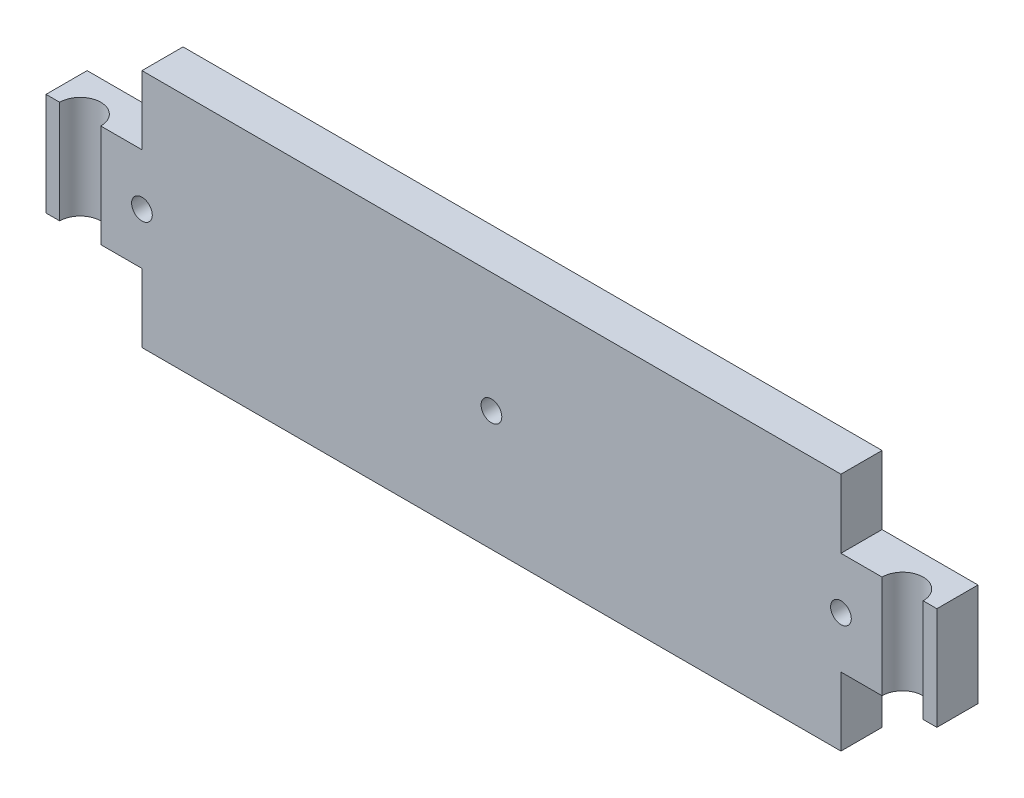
ISO-10303-21;
HEADER;
FILE_DESCRIPTION(('STEP AP214'),'2;1');
FILE_NAME('part.step','',(''),(''),'','','');
FILE_SCHEMA(('AUTOMOTIVE_DESIGN { 1 0 10303 214 1 1 1 1 }'));
ENDSEC;
DATA;
#1=APPLICATION_CONTEXT('core data for automotive mechanical design processes');
#2=APPLICATION_PROTOCOL_DEFINITION('international standard','automotive_design',2000,#1);
#3=PRODUCT_CONTEXT('',#1,'mechanical');
#4=PRODUCT('Part','Part','',(#3));
#5=PRODUCT_RELATED_PRODUCT_CATEGORY('part','',(#4));
#6=PRODUCT_DEFINITION_FORMATION('','',#4);
#7=PRODUCT_DEFINITION_CONTEXT('part definition',#1,'design');
#8=PRODUCT_DEFINITION('design','',#6,#7);
#9=PRODUCT_DEFINITION_SHAPE('','',#8);
#10=(LENGTH_UNIT() NAMED_UNIT(*) SI_UNIT(.MILLI.,.METRE.));
#11=(NAMED_UNIT(*) PLANE_ANGLE_UNIT() SI_UNIT($,.RADIAN.));
#12=(NAMED_UNIT(*) SI_UNIT($,.STERADIAN.) SOLID_ANGLE_UNIT());
#13=UNCERTAINTY_MEASURE_WITH_UNIT(LENGTH_MEASURE(1.E-05),#10,'distance_accuracy_value','');
#14=(GEOMETRIC_REPRESENTATION_CONTEXT(3) GLOBAL_UNCERTAINTY_ASSIGNED_CONTEXT((#13)) GLOBAL_UNIT_ASSIGNED_CONTEXT((#10,
#11,#12)) REPRESENTATION_CONTEXT('',''));
#15=CARTESIAN_POINT('',(0.,0.,0.));
#16=DIRECTION('',(0.,0.,1.));
#17=DIRECTION('',(1.,0.,0.));
#18=AXIS2_PLACEMENT_3D('',#15,#16,#17);
#19=CARTESIAN_POINT('',(-5.,25.,6.));
#20=DIRECTION('',(0.,0.,1.));
#21=DIRECTION('',(1.,0.,0.));
#22=AXIS2_PLACEMENT_3D('',#19,#20,#21);
#23=PLANE('',#22);
#24=DIRECTION('',(0.,1.,0.));
#25=VECTOR('',#24,1.);
#26=CARTESIAN_POINT('',(123.,0.,6.));
#27=LINE('',#26,#25);
#28=CARTESIAN_POINT('',(123.,10.,6.));
#29=VERTEX_POINT('',#28);
#30=CARTESIAN_POINT('',(123.,25.,6.));
#31=VERTEX_POINT('',#30);
#32=EDGE_CURVE('E46',#29,#31,#27,.T.);
#33=ORIENTED_EDGE('',*,*,#32,.F.);
#34=DIRECTION('',(1.,0.,0.));
#35=VECTOR('',#34,1.);
#36=CARTESIAN_POINT('',(111.,10.,6.));
#37=LINE('',#36,#35);
#38=CARTESIAN_POINT('',(125.,10.,6.));
#39=VERTEX_POINT('',#38);
#40=EDGE_CURVE('E230',#29,#39,#37,.T.);
#41=ORIENTED_EDGE('',*,*,#40,.T.);
#42=DIRECTION('',(0.,1.,0.));
#43=VECTOR('',#42,1.);
#44=CARTESIAN_POINT('',(125.,10.,6.));
#45=LINE('',#44,#43);
#46=CARTESIAN_POINT('',(125.,25.,6.));
#47=VERTEX_POINT('',#46);
#48=EDGE_CURVE('E162',#39,#47,#45,.T.);
#49=ORIENTED_EDGE('',*,*,#48,.T.);
#50=DIRECTION('',(-1.,0.,0.));
#51=VECTOR('',#50,1.);
#52=CARTESIAN_POINT('',(125.,25.,6.));
#53=LINE('',#52,#51);
#54=EDGE_CURVE('E161',#47,#31,#53,.T.);
#55=ORIENTED_EDGE('',*,*,#54,.T.);
#56=EDGE_LOOP('',(#33,#41,#49,#55));
#57=FACE_BOUND('',#56,.T.);
#58=ADVANCED_FACE('F31',(#57),#23,.T.);
#59=DIRECTION('',(0.,1.,0.));
#60=VECTOR('',#59,1.);
#61=CARTESIAN_POINT('',(117.,0.,6.));
#62=LINE('',#61,#60);
#63=CARTESIAN_POINT('',(117.,25.,6.));
#64=VERTEX_POINT('',#63);
#65=CARTESIAN_POINT('',(117.,10.,6.));
#66=VERTEX_POINT('',#65);
#67=EDGE_CURVE('E142',#64,#66,#62,.F.);
#68=ORIENTED_EDGE('',*,*,#67,.F.);
#69=CARTESIAN_POINT('',(111.,25.,6.));
#70=VERTEX_POINT('',#69);
#71=EDGE_CURVE('E152',#64,#70,#53,.T.);
#72=ORIENTED_EDGE('',*,*,#71,.T.);
#73=DIRECTION('',(0.,1.,0.));
#74=VECTOR('',#73,1.);
#75=CARTESIAN_POINT('',(111.,25.,6.));
#76=LINE('',#75,#74);
#77=CARTESIAN_POINT('',(111.,35.,6.));
#78=VERTEX_POINT('',#77);
#79=EDGE_CURVE('E164',#70,#78,#76,.T.);
#80=ORIENTED_EDGE('',*,*,#79,.T.);
#81=DIRECTION('',(-1.,0.,0.));
#82=VECTOR('',#81,1.);
#83=CARTESIAN_POINT('',(111.,35.,6.));
#84=LINE('',#83,#82);
#85=CARTESIAN_POINT('',(9.,35.,6.));
#86=VERTEX_POINT('',#85);
#87=EDGE_CURVE('E169',#78,#86,#84,.T.);
#88=ORIENTED_EDGE('',*,*,#87,.T.);
#89=DIRECTION('',(0.,-1.,0.));
#90=VECTOR('',#89,1.);
#91=CARTESIAN_POINT('',(9.,35.,6.));
#92=LINE('',#91,#90);
#93=CARTESIAN_POINT('',(8.99999999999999,25.,6.));
#94=VERTEX_POINT('',#93);
#95=EDGE_CURVE('E171',#86,#94,#92,.T.);
#96=ORIENTED_EDGE('',*,*,#95,.T.);
#97=DIRECTION('',(-1.,0.,0.));
#98=VECTOR('',#97,1.);
#99=CARTESIAN_POINT('',(8.99999999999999,25.,6.));
#100=LINE('',#99,#98);
#101=CARTESIAN_POINT('',(2.99999999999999,25.,6.));
#102=VERTEX_POINT('',#101);
#103=EDGE_CURVE('E262',#94,#102,#100,.T.);
#104=ORIENTED_EDGE('',*,*,#103,.T.);
#105=DIRECTION('',(0.,1.,0.));
#106=VECTOR('',#105,1.);
#107=CARTESIAN_POINT('',(3.,0.,6.));
#108=LINE('',#107,#106);
#109=CARTESIAN_POINT('',(3.,10.,6.));
#110=VERTEX_POINT('',#109);
#111=EDGE_CURVE('E299',#110,#102,#108,.T.);
#112=ORIENTED_EDGE('',*,*,#111,.F.);
#113=DIRECTION('',(1.,0.,0.));
#114=VECTOR('',#113,1.);
#115=CARTESIAN_POINT('',(-5.,10.,6.));
#116=LINE('',#115,#114);
#117=CARTESIAN_POINT('',(9.,10.,6.));
#118=VERTEX_POINT('',#117);
#119=EDGE_CURVE('E213',#110,#118,#116,.T.);
#120=ORIENTED_EDGE('',*,*,#119,.T.);
#121=DIRECTION('',(0.,-1.,0.));
#122=VECTOR('',#121,1.);
#123=CARTESIAN_POINT('',(9.,10.,6.));
#124=LINE('',#123,#122);
#125=CARTESIAN_POINT('',(9.,0.,6.));
#126=VERTEX_POINT('',#125);
#127=EDGE_CURVE('E221',#118,#126,#124,.T.);
#128=ORIENTED_EDGE('',*,*,#127,.T.);
#129=DIRECTION('',(1.,0.,0.));
#130=VECTOR('',#129,1.);
#131=CARTESIAN_POINT('',(9.,0.,6.));
#132=LINE('',#131,#130);
#133=CARTESIAN_POINT('',(111.,0.,6.));
#134=VERTEX_POINT('',#133);
#135=EDGE_CURVE('E223',#126,#134,#132,.T.);
#136=ORIENTED_EDGE('',*,*,#135,.T.);
#137=DIRECTION('',(0.,1.,0.));
#138=VECTOR('',#137,1.);
#139=CARTESIAN_POINT('',(111.,0.,6.));
#140=LINE('',#139,#138);
#141=CARTESIAN_POINT('',(111.,10.,6.));
#142=VERTEX_POINT('',#141);
#143=EDGE_CURVE('E229',#134,#142,#140,.T.);
#144=ORIENTED_EDGE('',*,*,#143,.T.);
#145=EDGE_CURVE('E155',#142,#66,#37,.T.);
#146=ORIENTED_EDGE('',*,*,#145,.T.);
#147=EDGE_LOOP('',(#68,#72,#80,#88,#96,#104,#112,#120,#128,#136,#144,#146));
#148=FACE_BOUND('',#147,.T.);
#149=CARTESIAN_POINT('',(111.,17.5,6.));
#150=DIRECTION('',(0.,0.,1.));
#151=DIRECTION('',(1.,0.,0.));
#152=AXIS2_PLACEMENT_3D('',#149,#150,#151);
#153=CIRCLE('',#152,1.51000000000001);
#154=CARTESIAN_POINT('',(112.51,17.5,6.));
#155=VERTEX_POINT('',#154);
#156=EDGE_CURVE('E309',#155,#155,#153,.T.);
#157=ORIENTED_EDGE('',*,*,#156,.F.);
#158=EDGE_LOOP('',(#157));
#159=FACE_BOUND('',#158,.T.);
#160=CARTESIAN_POINT('',(8.99999999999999,17.5,6.));
#161=DIRECTION('',(0.,0.,1.));
#162=DIRECTION('',(1.,0.,0.));
#163=AXIS2_PLACEMENT_3D('',#160,#161,#162);
#164=CIRCLE('',#163,1.51);
#165=CARTESIAN_POINT('',(10.51,17.5,6.));
#166=VERTEX_POINT('',#165);
#167=EDGE_CURVE('E275',#166,#166,#164,.T.);
#168=ORIENTED_EDGE('',*,*,#167,.F.);
#169=EDGE_LOOP('',(#168));
#170=FACE_BOUND('',#169,.T.);
#171=CARTESIAN_POINT('',(60.,17.5,6.));
#172=DIRECTION('',(0.,0.,1.));
#173=DIRECTION('',(1.,0.,0.));
#174=AXIS2_PLACEMENT_3D('',#171,#172,#173);
#175=CIRCLE('',#174,1.51);
#176=CARTESIAN_POINT('',(61.51,17.5,6.));
#177=VERTEX_POINT('',#176);
#178=EDGE_CURVE('E315',#177,#177,#175,.T.);
#179=ORIENTED_EDGE('',*,*,#178,.F.);
#180=EDGE_LOOP('',(#179));
#181=FACE_BOUND('',#180,.T.);
#182=ADVANCED_FACE('F150',(#148,#159,#170,#181),#23,.T.);
#183=DIRECTION('',(0.,1.,0.));
#184=VECTOR('',#183,1.);
#185=CARTESIAN_POINT('',(-3.,0.,6.));
#186=LINE('',#185,#184);
#187=CARTESIAN_POINT('',(-3.00000000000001,25.,6.));
#188=VERTEX_POINT('',#187);
#189=CARTESIAN_POINT('',(-3.,10.,6.));
#190=VERTEX_POINT('',#189);
#191=EDGE_CURVE('E53',#188,#190,#186,.F.);
#192=ORIENTED_EDGE('',*,*,#191,.F.);
#193=CARTESIAN_POINT('',(-5.,25.,6.));
#194=VERTEX_POINT('',#193);
#195=EDGE_CURVE('E261',#188,#194,#100,.T.);
#196=ORIENTED_EDGE('',*,*,#195,.T.);
#197=DIRECTION('',(0.,-1.,0.));
#198=VECTOR('',#197,1.);
#199=CARTESIAN_POINT('',(-5.,25.,6.));
#200=LINE('',#199,#198);
#201=CARTESIAN_POINT('',(-5.,10.,6.));
#202=VERTEX_POINT('',#201);
#203=EDGE_CURVE('E219',#194,#202,#200,.T.);
#204=ORIENTED_EDGE('',*,*,#203,.T.);
#205=EDGE_CURVE('E211',#202,#190,#116,.T.);
#206=ORIENTED_EDGE('',*,*,#205,.T.);
#207=EDGE_LOOP('',(#192,#196,#204,#206));
#208=FACE_BOUND('',#207,.T.);
#209=ADVANCED_FACE('F216',(#208),#23,.T.);
#210=CARTESIAN_POINT('',(-5.,25.,0.));
#211=DIRECTION('',(0.,0.,1.));
#212=DIRECTION('',(1.,0.,0.));
#213=AXIS2_PLACEMENT_3D('',#210,#211,#212);
#214=PLANE('',#213);
#215=CARTESIAN_POINT('',(60.,17.5,0.));
#216=DIRECTION('',(0.,0.,1.));
#217=DIRECTION('',(1.,0.,0.));
#218=AXIS2_PLACEMENT_3D('',#215,#216,#217);
#219=CIRCLE('',#218,1.51);
#220=CARTESIAN_POINT('',(61.51,17.5,0.));
#221=VERTEX_POINT('',#220);
#222=EDGE_CURVE('E312',#221,#221,#219,.T.);
#223=ORIENTED_EDGE('',*,*,#222,.T.);
#224=EDGE_LOOP('',(#223));
#225=FACE_BOUND('',#224,.T.);
#226=DIRECTION('',(-1.,0.,0.));
#227=VECTOR('',#226,1.);
#228=CARTESIAN_POINT('',(8.99999999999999,25.,0.));
#229=LINE('',#228,#227);
#230=CARTESIAN_POINT('',(8.99999999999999,25.,0.));
#231=VERTEX_POINT('',#230);
#232=CARTESIAN_POINT('',(-5.,25.,0.));
#233=VERTEX_POINT('',#232);
#234=EDGE_CURVE('E271',#231,#233,#229,.T.);
#235=ORIENTED_EDGE('',*,*,#234,.F.);
#236=DIRECTION('',(0.,-1.,0.));
#237=VECTOR('',#236,1.);
#238=CARTESIAN_POINT('',(9.,35.,0.));
#239=LINE('',#238,#237);
#240=CARTESIAN_POINT('',(9.,35.,0.));
#241=VERTEX_POINT('',#240);
#242=EDGE_CURVE('E260',#241,#231,#239,.T.);
#243=ORIENTED_EDGE('',*,*,#242,.F.);
#244=DIRECTION('',(-1.,0.,0.));
#245=VECTOR('',#244,1.);
#246=CARTESIAN_POINT('',(111.,35.,0.));
#247=LINE('',#246,#245);
#248=CARTESIAN_POINT('',(111.,35.,0.));
#249=VERTEX_POINT('',#248);
#250=EDGE_CURVE('E254',#249,#241,#247,.T.);
#251=ORIENTED_EDGE('',*,*,#250,.F.);
#252=DIRECTION('',(0.,1.,0.));
#253=VECTOR('',#252,1.);
#254=CARTESIAN_POINT('',(111.,25.,0.));
#255=LINE('',#254,#253);
#256=CARTESIAN_POINT('',(111.,25.,0.));
#257=VERTEX_POINT('',#256);
#258=EDGE_CURVE('E252',#257,#249,#255,.T.);
#259=ORIENTED_EDGE('',*,*,#258,.F.);
#260=DIRECTION('',(-1.,0.,0.));
#261=VECTOR('',#260,1.);
#262=CARTESIAN_POINT('',(125.,25.,0.));
#263=LINE('',#262,#261);
#264=CARTESIAN_POINT('',(125.,25.,0.));
#265=VERTEX_POINT('',#264);
#266=EDGE_CURVE('E245',#265,#257,#263,.T.);
#267=ORIENTED_EDGE('',*,*,#266,.F.);
#268=DIRECTION('',(0.,1.,0.));
#269=VECTOR('',#268,1.);
#270=CARTESIAN_POINT('',(125.,10.,0.));
#271=LINE('',#270,#269);
#272=CARTESIAN_POINT('',(125.,10.,0.));
#273=VERTEX_POINT('',#272);
#274=EDGE_CURVE('E243',#273,#265,#271,.T.);
#275=ORIENTED_EDGE('',*,*,#274,.F.);
#276=DIRECTION('',(1.,0.,0.));
#277=VECTOR('',#276,1.);
#278=CARTESIAN_POINT('',(111.,10.,0.));
#279=LINE('',#278,#277);
#280=CARTESIAN_POINT('',(111.,10.,0.));
#281=VERTEX_POINT('',#280);
#282=EDGE_CURVE('E239',#281,#273,#279,.T.);
#283=ORIENTED_EDGE('',*,*,#282,.F.);
#284=DIRECTION('',(0.,1.,0.));
#285=VECTOR('',#284,1.);
#286=CARTESIAN_POINT('',(111.,0.,0.));
#287=LINE('',#286,#285);
#288=CARTESIAN_POINT('',(111.,0.,0.));
#289=VERTEX_POINT('',#288);
#290=EDGE_CURVE('E289',#289,#281,#287,.T.);
#291=ORIENTED_EDGE('',*,*,#290,.F.);
#292=DIRECTION('',(1.,0.,0.));
#293=VECTOR('',#292,1.);
#294=CARTESIAN_POINT('',(9.,0.,0.));
#295=LINE('',#294,#293);
#296=CARTESIAN_POINT('',(9.,0.,0.));
#297=VERTEX_POINT('',#296);
#298=EDGE_CURVE('E287',#297,#289,#295,.T.);
#299=ORIENTED_EDGE('',*,*,#298,.F.);
#300=DIRECTION('',(0.,-1.,0.));
#301=VECTOR('',#300,1.);
#302=CARTESIAN_POINT('',(9.,10.,0.));
#303=LINE('',#302,#301);
#304=CARTESIAN_POINT('',(9.,10.,0.));
#305=VERTEX_POINT('',#304);
#306=EDGE_CURVE('E285',#305,#297,#303,.T.);
#307=ORIENTED_EDGE('',*,*,#306,.F.);
#308=DIRECTION('',(1.,0.,0.));
#309=VECTOR('',#308,1.);
#310=CARTESIAN_POINT('',(-5.,10.,0.));
#311=LINE('',#310,#309);
#312=CARTESIAN_POINT('',(-5.,10.,0.));
#313=VERTEX_POINT('',#312);
#314=EDGE_CURVE('E277',#313,#305,#311,.T.);
#315=ORIENTED_EDGE('',*,*,#314,.F.);
#316=DIRECTION('',(0.,-1.,0.));
#317=VECTOR('',#316,1.);
#318=CARTESIAN_POINT('',(-5.,25.,0.));
#319=LINE('',#318,#317);
#320=EDGE_CURVE('E274',#233,#313,#319,.T.);
#321=ORIENTED_EDGE('',*,*,#320,.F.);
#322=EDGE_LOOP('',(#235,#243,#251,#259,#267,#275,#283,#291,#299,#307,#315,#321));
#323=FACE_BOUND('',#322,.T.);
#324=CARTESIAN_POINT('',(8.99999999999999,17.5,0.));
#325=DIRECTION('',(0.,0.,1.));
#326=DIRECTION('',(1.,0.,0.));
#327=AXIS2_PLACEMENT_3D('',#324,#325,#326);
#328=CIRCLE('',#327,1.51);
#329=CARTESIAN_POINT('',(10.51,17.5,0.));
#330=VERTEX_POINT('',#329);
#331=EDGE_CURVE('E280',#330,#330,#328,.T.);
#332=ORIENTED_EDGE('',*,*,#331,.T.);
#333=EDGE_LOOP('',(#332));
#334=FACE_BOUND('',#333,.T.);
#335=CARTESIAN_POINT('',(111.,17.5,0.));
#336=DIRECTION('',(0.,0.,1.));
#337=DIRECTION('',(1.,0.,0.));
#338=AXIS2_PLACEMENT_3D('',#335,#336,#337);
#339=CIRCLE('',#338,1.51000000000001);
#340=CARTESIAN_POINT('',(112.51,17.5,0.));
#341=VERTEX_POINT('',#340);
#342=EDGE_CURVE('E306',#341,#341,#339,.T.);
#343=ORIENTED_EDGE('',*,*,#342,.T.);
#344=EDGE_LOOP('',(#343));
#345=FACE_BOUND('',#344,.T.);
#346=ADVANCED_FACE('F249',(#225,#323,#334,#345),#214,.F.);
#347=CARTESIAN_POINT('',(8.99999999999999,25.,6.));
#348=DIRECTION('',(0.,-1.,0.));
#349=DIRECTION('',(1.,0.,0.));
#350=AXIS2_PLACEMENT_3D('',#347,#348,#349);
#351=PLANE('',#350);
#352=ORIENTED_EDGE('',*,*,#195,.F.);
#353=CARTESIAN_POINT('',(0.,25.,6.));
#354=DIRECTION('',(0.,-1.,0.));
#355=DIRECTION('',(1.,0.,0.));
#356=AXIS2_PLACEMENT_3D('',#353,#354,#355);
#357=CIRCLE('',#356,3.);
#358=EDGE_CURVE('E304',#188,#102,#357,.T.);
#359=ORIENTED_EDGE('',*,*,#358,.T.);
#360=ORIENTED_EDGE('',*,*,#103,.F.);
#361=DIRECTION('',(0.,0.,-1.));
#362=VECTOR('',#361,1.);
#363=CARTESIAN_POINT('',(8.99999999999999,25.,6.));
#364=LINE('',#363,#362);
#365=EDGE_CURVE('E173',#94,#231,#364,.T.);
#366=ORIENTED_EDGE('',*,*,#365,.T.);
#367=ORIENTED_EDGE('',*,*,#234,.T.);
#368=DIRECTION('',(0.,0.,-1.));
#369=VECTOR('',#368,1.);
#370=CARTESIAN_POINT('',(-5.,25.,6.));
#371=LINE('',#370,#369);
#372=EDGE_CURVE('E204',#194,#233,#371,.T.);
#373=ORIENTED_EDGE('',*,*,#372,.F.);
#374=EDGE_LOOP('',(#352,#359,#360,#366,#367,#373));
#375=FACE_BOUND('',#374,.T.);
#376=ADVANCED_FACE('F33',(#375),#351,.F.);
#377=CARTESIAN_POINT('',(-5.,25.,6.));
#378=DIRECTION('',(1.,0.,0.));
#379=DIRECTION('',(0.,1.,0.));
#380=AXIS2_PLACEMENT_3D('',#377,#378,#379);
#381=PLANE('',#380);
#382=ORIENTED_EDGE('',*,*,#320,.T.);
#383=DIRECTION('',(0.,0.,-1.));
#384=VECTOR('',#383,1.);
#385=CARTESIAN_POINT('',(-5.,10.,6.));
#386=LINE('',#385,#384);
#387=EDGE_CURVE('E201',#202,#313,#386,.T.);
#388=ORIENTED_EDGE('',*,*,#387,.F.);
#389=ORIENTED_EDGE('',*,*,#203,.F.);
#390=ORIENTED_EDGE('',*,*,#372,.T.);
#391=EDGE_LOOP('',(#382,#388,#389,#390));
#392=FACE_BOUND('',#391,.T.);
#393=ADVANCED_FACE('F269',(#392),#381,.F.);
#394=CARTESIAN_POINT('',(-5.,10.,6.));
#395=DIRECTION('',(0.,1.,0.));
#396=DIRECTION('',(0.,0.,1.));
#397=AXIS2_PLACEMENT_3D('',#394,#395,#396);
#398=PLANE('',#397);
#399=ORIENTED_EDGE('',*,*,#119,.F.);
#400=CARTESIAN_POINT('',(0.,10.,6.));
#401=DIRECTION('',(0.,1.,0.));
#402=DIRECTION('',(0.,0.,1.));
#403=AXIS2_PLACEMENT_3D('',#400,#401,#402);
#404=CIRCLE('',#403,3.);
#405=EDGE_CURVE('E39',#110,#190,#404,.T.);
#406=ORIENTED_EDGE('',*,*,#405,.T.);
#407=ORIENTED_EDGE('',*,*,#205,.F.);
#408=ORIENTED_EDGE('',*,*,#387,.T.);
#409=ORIENTED_EDGE('',*,*,#314,.T.);
#410=DIRECTION('',(0.,0.,-1.));
#411=VECTOR('',#410,1.);
#412=CARTESIAN_POINT('',(9.,10.,6.));
#413=LINE('',#412,#411);
#414=EDGE_CURVE('E198',#118,#305,#413,.T.);
#415=ORIENTED_EDGE('',*,*,#414,.F.);
#416=EDGE_LOOP('',(#399,#406,#407,#408,#409,#415));
#417=FACE_BOUND('',#416,.T.);
#418=ADVANCED_FACE('F210',(#417),#398,.F.);
#419=CARTESIAN_POINT('',(9.,10.,6.));
#420=DIRECTION('',(1.,0.,0.));
#421=DIRECTION('',(0.,0.,-1.));
#422=AXIS2_PLACEMENT_3D('',#419,#420,#421);
#423=PLANE('',#422);
#424=ORIENTED_EDGE('',*,*,#306,.T.);
#425=DIRECTION('',(0.,0.,-1.));
#426=VECTOR('',#425,1.);
#427=CARTESIAN_POINT('',(9.,0.,6.));
#428=LINE('',#427,#426);
#429=EDGE_CURVE('E195',#126,#297,#428,.T.);
#430=ORIENTED_EDGE('',*,*,#429,.F.);
#431=ORIENTED_EDGE('',*,*,#127,.F.);
#432=ORIENTED_EDGE('',*,*,#414,.T.);
#433=EDGE_LOOP('',(#424,#430,#431,#432));
#434=FACE_BOUND('',#433,.T.);
#435=ADVANCED_FACE('F361',(#434),#423,.F.);
#436=CARTESIAN_POINT('',(9.,0.,6.));
#437=DIRECTION('',(0.,1.,0.));
#438=DIRECTION('',(0.,0.,1.));
#439=AXIS2_PLACEMENT_3D('',#436,#437,#438);
#440=PLANE('',#439);
#441=ORIENTED_EDGE('',*,*,#298,.T.);
#442=DIRECTION('',(0.,0.,-1.));
#443=VECTOR('',#442,1.);
#444=CARTESIAN_POINT('',(111.,0.,6.));
#445=LINE('',#444,#443);
#446=EDGE_CURVE('E192',#134,#289,#445,.T.);
#447=ORIENTED_EDGE('',*,*,#446,.F.);
#448=ORIENTED_EDGE('',*,*,#135,.F.);
#449=ORIENTED_EDGE('',*,*,#429,.T.);
#450=EDGE_LOOP('',(#441,#447,#448,#449));
#451=FACE_BOUND('',#450,.T.);
#452=ADVANCED_FACE('F365',(#451),#440,.F.);
#453=CARTESIAN_POINT('',(111.,0.,6.));
#454=DIRECTION('',(-1.,0.,0.));
#455=DIRECTION('',(0.,0.,1.));
#456=AXIS2_PLACEMENT_3D('',#453,#454,#455);
#457=PLANE('',#456);
#458=ORIENTED_EDGE('',*,*,#290,.T.);
#459=DIRECTION('',(0.,0.,-1.));
#460=VECTOR('',#459,1.);
#461=CARTESIAN_POINT('',(111.,10.,6.));
#462=LINE('',#461,#460);
#463=EDGE_CURVE('E189',#142,#281,#462,.T.);
#464=ORIENTED_EDGE('',*,*,#463,.F.);
#465=ORIENTED_EDGE('',*,*,#143,.F.);
#466=ORIENTED_EDGE('',*,*,#446,.T.);
#467=EDGE_LOOP('',(#458,#464,#465,#466));
#468=FACE_BOUND('',#467,.T.);
#469=ADVANCED_FACE('F293',(#468),#457,.F.);
#470=CARTESIAN_POINT('',(111.,10.,6.));
#471=DIRECTION('',(0.,1.,0.));
#472=DIRECTION('',(0.,0.,1.));
#473=AXIS2_PLACEMENT_3D('',#470,#471,#472);
#474=PLANE('',#473);
#475=ORIENTED_EDGE('',*,*,#40,.F.);
#476=CARTESIAN_POINT('',(120.,10.,5.99999999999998));
#477=DIRECTION('',(0.,1.,0.));
#478=DIRECTION('',(0.,0.,1.));
#479=AXIS2_PLACEMENT_3D('',#476,#477,#478);
#480=CIRCLE('',#479,3.00000000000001);
#481=EDGE_CURVE('E297',#29,#66,#480,.T.);
#482=ORIENTED_EDGE('',*,*,#481,.T.);
#483=ORIENTED_EDGE('',*,*,#145,.F.);
#484=ORIENTED_EDGE('',*,*,#463,.T.);
#485=ORIENTED_EDGE('',*,*,#282,.T.);
#486=DIRECTION('',(0.,0.,-1.));
#487=VECTOR('',#486,1.);
#488=CARTESIAN_POINT('',(125.,10.,6.));
#489=LINE('',#488,#487);
#490=EDGE_CURVE('E186',#39,#273,#489,.T.);
#491=ORIENTED_EDGE('',*,*,#490,.F.);
#492=EDGE_LOOP('',(#475,#482,#483,#484,#485,#491));
#493=FACE_BOUND('',#492,.T.);
#494=ADVANCED_FACE('F237',(#493),#474,.F.);
#495=CARTESIAN_POINT('',(125.,10.,6.));
#496=DIRECTION('',(-1.,0.,0.));
#497=DIRECTION('',(0.,0.,1.));
#498=AXIS2_PLACEMENT_3D('',#495,#496,#497);
#499=PLANE('',#498);
#500=ORIENTED_EDGE('',*,*,#274,.T.);
#501=DIRECTION('',(0.,0.,-1.));
#502=VECTOR('',#501,1.);
#503=CARTESIAN_POINT('',(125.,25.,6.));
#504=LINE('',#503,#502);
#505=EDGE_CURVE('E183',#47,#265,#504,.T.);
#506=ORIENTED_EDGE('',*,*,#505,.F.);
#507=ORIENTED_EDGE('',*,*,#48,.F.);
#508=ORIENTED_EDGE('',*,*,#490,.T.);
#509=EDGE_LOOP('',(#500,#506,#507,#508));
#510=FACE_BOUND('',#509,.T.);
#511=ADVANCED_FACE('F242',(#510),#499,.F.);
#512=CARTESIAN_POINT('',(125.,25.,6.));
#513=DIRECTION('',(0.,-1.,0.));
#514=DIRECTION('',(1.,0.,0.));
#515=AXIS2_PLACEMENT_3D('',#512,#513,#514);
#516=PLANE('',#515);
#517=ORIENTED_EDGE('',*,*,#71,.F.);
#518=CARTESIAN_POINT('',(120.,25.,5.99999999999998));
#519=DIRECTION('',(0.,-1.,0.));
#520=DIRECTION('',(1.,0.,0.));
#521=AXIS2_PLACEMENT_3D('',#518,#519,#520);
#522=CIRCLE('',#521,3.00000000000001);
#523=EDGE_CURVE('E11',#64,#31,#522,.T.);
#524=ORIENTED_EDGE('',*,*,#523,.T.);
#525=ORIENTED_EDGE('',*,*,#54,.F.);
#526=ORIENTED_EDGE('',*,*,#505,.T.);
#527=ORIENTED_EDGE('',*,*,#266,.T.);
#528=DIRECTION('',(0.,0.,-1.));
#529=VECTOR('',#528,1.);
#530=CARTESIAN_POINT('',(111.,25.,6.));
#531=LINE('',#530,#529);
#532=EDGE_CURVE('E159',#70,#257,#531,.T.);
#533=ORIENTED_EDGE('',*,*,#532,.F.);
#534=EDGE_LOOP('',(#517,#524,#525,#526,#527,#533));
#535=FACE_BOUND('',#534,.T.);
#536=ADVANCED_FACE('F157',(#535),#516,.F.);
#537=CARTESIAN_POINT('',(111.,25.,6.));
#538=DIRECTION('',(-1.,0.,0.));
#539=DIRECTION('',(0.,0.,1.));
#540=AXIS2_PLACEMENT_3D('',#537,#538,#539);
#541=PLANE('',#540);
#542=ORIENTED_EDGE('',*,*,#258,.T.);
#543=DIRECTION('',(0.,0.,-1.));
#544=VECTOR('',#543,1.);
#545=CARTESIAN_POINT('',(111.,35.,6.));
#546=LINE('',#545,#544);
#547=EDGE_CURVE('E179',#78,#249,#546,.T.);
#548=ORIENTED_EDGE('',*,*,#547,.F.);
#549=ORIENTED_EDGE('',*,*,#79,.F.);
#550=ORIENTED_EDGE('',*,*,#532,.T.);
#551=EDGE_LOOP('',(#542,#548,#549,#550));
#552=FACE_BOUND('',#551,.T.);
#553=ADVANCED_FACE('F378',(#552),#541,.F.);
#554=CARTESIAN_POINT('',(111.,35.,6.));
#555=DIRECTION('',(0.,-1.,0.));
#556=DIRECTION('',(1.,0.,0.));
#557=AXIS2_PLACEMENT_3D('',#554,#555,#556);
#558=PLANE('',#557);
#559=ORIENTED_EDGE('',*,*,#250,.T.);
#560=DIRECTION('',(0.,0.,-1.));
#561=VECTOR('',#560,1.);
#562=CARTESIAN_POINT('',(9.,35.,6.));
#563=LINE('',#562,#561);
#564=EDGE_CURVE('E176',#86,#241,#563,.T.);
#565=ORIENTED_EDGE('',*,*,#564,.F.);
#566=ORIENTED_EDGE('',*,*,#87,.F.);
#567=ORIENTED_EDGE('',*,*,#547,.T.);
#568=EDGE_LOOP('',(#559,#565,#566,#567));
#569=FACE_BOUND('',#568,.T.);
#570=ADVANCED_FACE('F334',(#569),#558,.F.);
#571=CARTESIAN_POINT('',(9.,35.,6.));
#572=DIRECTION('',(1.,0.,0.));
#573=DIRECTION('',(0.,1.,0.));
#574=AXIS2_PLACEMENT_3D('',#571,#572,#573);
#575=PLANE('',#574);
#576=ORIENTED_EDGE('',*,*,#242,.T.);
#577=ORIENTED_EDGE('',*,*,#365,.F.);
#578=ORIENTED_EDGE('',*,*,#95,.F.);
#579=ORIENTED_EDGE('',*,*,#564,.T.);
#580=EDGE_LOOP('',(#576,#577,#578,#579));
#581=FACE_BOUND('',#580,.T.);
#582=ADVANCED_FACE('F324',(#581),#575,.F.);
#583=CARTESIAN_POINT('',(8.99999999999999,17.5,6.));
#584=DIRECTION('',(0.,0.,-1.));
#585=DIRECTION('',(-1.,0.,0.));
#586=AXIS2_PLACEMENT_3D('',#583,#584,#585);
#587=CYLINDRICAL_SURFACE('',#586,1.51);
#588=ORIENTED_EDGE('',*,*,#167,.T.);
#589=EDGE_LOOP('',(#588));
#590=FACE_BOUND('',#589,.T.);
#591=ORIENTED_EDGE('',*,*,#331,.F.);
#592=EDGE_LOOP('',(#591));
#593=FACE_BOUND('',#592,.T.);
#594=ADVANCED_FACE('F321',(#590,#593),#587,.F.);
#595=CARTESIAN_POINT('',(60.,17.5,6.));
#596=DIRECTION('',(0.,0.,-1.));
#597=DIRECTION('',(-1.,0.,0.));
#598=AXIS2_PLACEMENT_3D('',#595,#596,#597);
#599=CYLINDRICAL_SURFACE('',#598,1.51);
#600=ORIENTED_EDGE('',*,*,#178,.T.);
#601=EDGE_LOOP('',(#600));
#602=FACE_BOUND('',#601,.T.);
#603=ORIENTED_EDGE('',*,*,#222,.F.);
#604=EDGE_LOOP('',(#603));
#605=FACE_BOUND('',#604,.T.);
#606=ADVANCED_FACE('F323',(#602,#605),#599,.F.);
#607=CARTESIAN_POINT('',(111.,17.5,6.));
#608=DIRECTION('',(0.,0.,-1.));
#609=DIRECTION('',(-1.,0.,0.));
#610=AXIS2_PLACEMENT_3D('',#607,#608,#609);
#611=CYLINDRICAL_SURFACE('',#610,1.51000000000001);
#612=ORIENTED_EDGE('',*,*,#156,.T.);
#613=EDGE_LOOP('',(#612));
#614=FACE_BOUND('',#613,.T.);
#615=ORIENTED_EDGE('',*,*,#342,.F.);
#616=EDGE_LOOP('',(#615));
#617=FACE_BOUND('',#616,.T.);
#618=ADVANCED_FACE('F331',(#614,#617),#611,.F.);
#619=CARTESIAN_POINT('',(0.,0.,6.));
#620=DIRECTION('',(0.,1.,0.));
#621=DIRECTION('',(-1.,0.,0.));
#622=AXIS2_PLACEMENT_3D('',#619,#620,#621);
#623=CYLINDRICAL_SURFACE('',#622,3.);
#624=ORIENTED_EDGE('',*,*,#191,.T.);
#625=ORIENTED_EDGE('',*,*,#405,.F.);
#626=ORIENTED_EDGE('',*,*,#111,.T.);
#627=ORIENTED_EDGE('',*,*,#358,.F.);
#628=EDGE_LOOP('',(#624,#625,#626,#627));
#629=FACE_BOUND('',#628,.T.);
#630=ADVANCED_FACE('F390',(#629),#623,.F.);
#631=CARTESIAN_POINT('',(120.,0.,5.99999999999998));
#632=DIRECTION('',(0.,1.,0.));
#633=DIRECTION('',(-1.,0.,0.));
#634=AXIS2_PLACEMENT_3D('',#631,#632,#633);
#635=CYLINDRICAL_SURFACE('',#634,3.00000000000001);
#636=ORIENTED_EDGE('',*,*,#32,.T.);
#637=ORIENTED_EDGE('',*,*,#523,.F.);
#638=ORIENTED_EDGE('',*,*,#67,.T.);
#639=ORIENTED_EDGE('',*,*,#481,.F.);
#640=EDGE_LOOP('',(#636,#637,#638,#639));
#641=FACE_BOUND('',#640,.T.);
#642=ADVANCED_FACE('F141',(#641),#635,.F.);
#643=CLOSED_SHELL('',(#58,#182,#209,#346,#376,#393,#418,#435,#452,#469,#494,#511,#536,#553,#570,
#582,#594,#606,#618,#630,#642));
#644=MANIFOLD_SOLID_BREP('B2',#643);
#645=ADVANCED_BREP_SHAPE_REPRESENTATION('',(#18,#644),#14);
#646=SHAPE_DEFINITION_REPRESENTATION(#9,#645);
ENDSEC;
END-ISO-10303-21;
